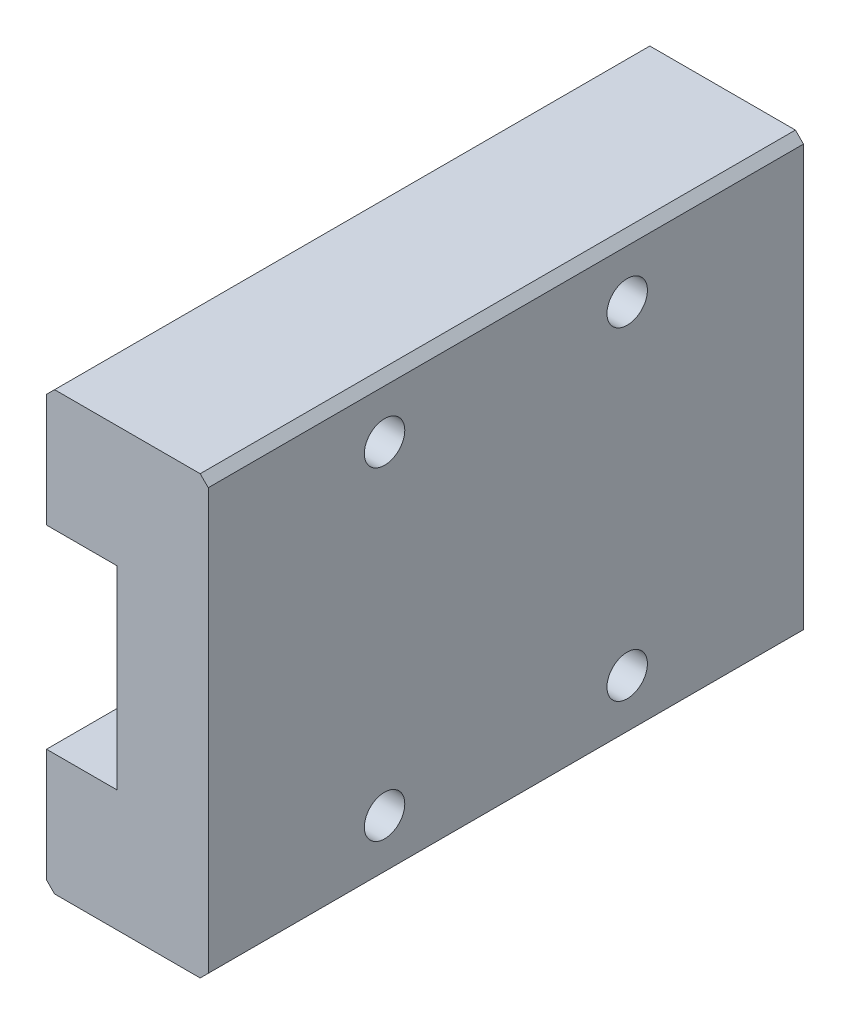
from build123d import *

# Parameters (mm, degrees)
EXTRUDE_1_DEPTH     = 36.8
SKETCH_2_R          = 1.25
CUT_EXTRUDE_1_DEPTH = 12


with BuildPart() as part:
    # Sketch 1 → Extrude 1 (new body)
    with BuildSketch(Plane.XY):
        Polygon((0.5, 0), (0, 0.5), (0, 7.5), (4.35, 7.5), (4.35, 19.5), (0, 19.5), (0, 26.5), (0.5, 27), (9.5, 27), (10, 26.5), (10, 0.5), (9.5, 0), align=None)
    extrude(amount=EXTRUDE_1_DEPTH)

    # Sketch 2 → Cut-Extrude 1 (cut)
    with BuildSketch(Plane(origin=(10, 0, 0), x_dir=(0, 0, -1), z_dir=(1, 0, 0))):
        with Locations((-25.9, 23.5)):
            Circle(SKETCH_2_R)
        with Locations((-25.9, 3.5)):
            Circle(SKETCH_2_R)
        with Locations((-10.9, 3.5)):
            Circle(SKETCH_2_R)
        with Locations((-10.9, 23.5)):
            Circle(SKETCH_2_R)
    extrude(amount=-CUT_EXTRUDE_1_DEPTH, mode=Mode.SUBTRACT)


solid = part.part
